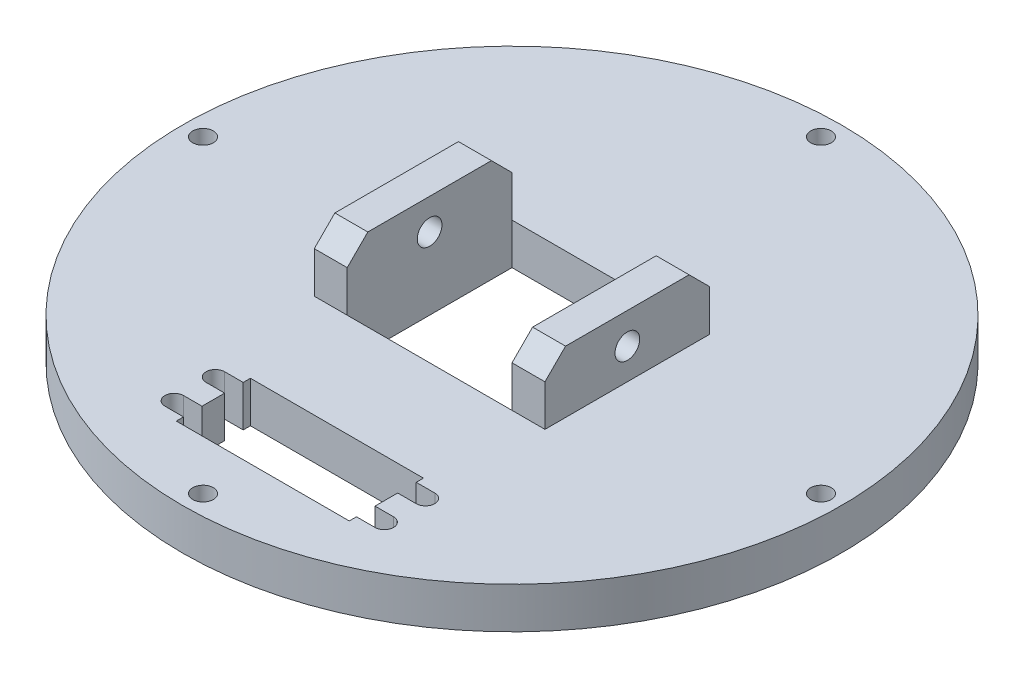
ISO-10303-21;
HEADER;
FILE_DESCRIPTION(('STEP AP214'),'2;1');
FILE_NAME('part.step','',(''),(''),'','','');
FILE_SCHEMA(('AUTOMOTIVE_DESIGN { 1 0 10303 214 1 1 1 1 }'));
ENDSEC;
DATA;
#1=APPLICATION_CONTEXT('core data for automotive mechanical design processes');
#2=APPLICATION_PROTOCOL_DEFINITION('international standard','automotive_design',2000,#1);
#3=PRODUCT_CONTEXT('',#1,'mechanical');
#4=PRODUCT('Part','Part','',(#3));
#5=PRODUCT_RELATED_PRODUCT_CATEGORY('part','',(#4));
#6=PRODUCT_DEFINITION_FORMATION('','',#4);
#7=PRODUCT_DEFINITION_CONTEXT('part definition',#1,'design');
#8=PRODUCT_DEFINITION('design','',#6,#7);
#9=PRODUCT_DEFINITION_SHAPE('','',#8);
#10=(LENGTH_UNIT() NAMED_UNIT(*) SI_UNIT(.MILLI.,.METRE.));
#11=(NAMED_UNIT(*) PLANE_ANGLE_UNIT() SI_UNIT($,.RADIAN.));
#12=(NAMED_UNIT(*) SI_UNIT($,.STERADIAN.) SOLID_ANGLE_UNIT());
#13=UNCERTAINTY_MEASURE_WITH_UNIT(LENGTH_MEASURE(1.E-05),#10,'distance_accuracy_value','');
#14=(GEOMETRIC_REPRESENTATION_CONTEXT(3) GLOBAL_UNCERTAINTY_ASSIGNED_CONTEXT((#13)) GLOBAL_UNIT_ASSIGNED_CONTEXT((#10,
#11,#12)) REPRESENTATION_CONTEXT('',''));
#15=CARTESIAN_POINT('',(0.,0.,0.));
#16=DIRECTION('',(0.,0.,1.));
#17=DIRECTION('',(1.,0.,0.));
#18=AXIS2_PLACEMENT_3D('',#15,#16,#17);
#19=CARTESIAN_POINT('',(0.,10.,0.));
#20=DIRECTION('',(0.,1.,0.));
#21=DIRECTION('',(0.,0.,1.));
#22=AXIS2_PLACEMENT_3D('',#19,#20,#21);
#23=PLANE('',#22);
#24=DIRECTION('',(-1.,0.,0.));
#25=VECTOR('',#24,1.);
#26=CARTESIAN_POINT('',(20.,10.,20.));
#27=LINE('',#26,#25);
#28=CARTESIAN_POINT('',(28.,10.,20.));
#29=VERTEX_POINT('',#28);
#30=CARTESIAN_POINT('',(20.,10.,20.));
#31=VERTEX_POINT('',#30);
#32=EDGE_CURVE('E534',#29,#31,#27,.T.);
#33=ORIENTED_EDGE('',*,*,#32,.T.);
#34=DIRECTION('',(1.,0.,0.));
#35=VECTOR('',#34,1.);
#36=CARTESIAN_POINT('',(-20.,10.,20.));
#37=LINE('',#36,#35);
#38=CARTESIAN_POINT('',(-20.,10.,20.));
#39=VERTEX_POINT('',#38);
#40=EDGE_CURVE('E546',#39,#31,#37,.T.);
#41=ORIENTED_EDGE('',*,*,#40,.F.);
#42=DIRECTION('',(1.,0.,0.));
#43=VECTOR('',#42,1.);
#44=CARTESIAN_POINT('',(-20.,10.,20.));
#45=LINE('',#44,#43);
#46=CARTESIAN_POINT('',(-28.,10.,20.));
#47=VERTEX_POINT('',#46);
#48=EDGE_CURVE('E680',#47,#39,#45,.T.);
#49=ORIENTED_EDGE('',*,*,#48,.F.);
#50=DIRECTION('',(0.,0.,1.));
#51=VECTOR('',#50,1.);
#52=CARTESIAN_POINT('',(-28.,10.,-20.));
#53=LINE('',#52,#51);
#54=CARTESIAN_POINT('',(-28.,10.,-20.));
#55=VERTEX_POINT('',#54);
#56=EDGE_CURVE('E686',#55,#47,#53,.T.);
#57=ORIENTED_EDGE('',*,*,#56,.F.);
#58=DIRECTION('',(-1.,0.,0.));
#59=VECTOR('',#58,1.);
#60=CARTESIAN_POINT('',(-20.,10.,-20.));
#61=LINE('',#60,#59);
#62=CARTESIAN_POINT('',(-20.,10.,-20.));
#63=VERTEX_POINT('',#62);
#64=EDGE_CURVE('E675',#63,#55,#61,.T.);
#65=ORIENTED_EDGE('',*,*,#64,.F.);
#66=DIRECTION('',(-1.,0.,0.));
#67=VECTOR('',#66,1.);
#68=CARTESIAN_POINT('',(-20.,10.,-20.));
#69=LINE('',#68,#67);
#70=CARTESIAN_POINT('',(20.,10.,-20.));
#71=VERTEX_POINT('',#70);
#72=EDGE_CURVE('E566',#71,#63,#69,.T.);
#73=ORIENTED_EDGE('',*,*,#72,.F.);
#74=DIRECTION('',(1.,0.,0.));
#75=VECTOR('',#74,1.);
#76=CARTESIAN_POINT('',(20.,10.,-20.));
#77=LINE('',#76,#75);
#78=CARTESIAN_POINT('',(28.,10.,-20.));
#79=VERTEX_POINT('',#78);
#80=EDGE_CURVE('E652',#71,#79,#77,.T.);
#81=ORIENTED_EDGE('',*,*,#80,.T.);
#82=DIRECTION('',(0.,0.,1.));
#83=VECTOR('',#82,1.);
#84=CARTESIAN_POINT('',(28.,10.,-20.));
#85=LINE('',#84,#83);
#86=EDGE_CURVE('E550',#79,#29,#85,.T.);
#87=ORIENTED_EDGE('',*,*,#86,.T.);
#88=EDGE_LOOP('',(#33,#41,#49,#57,#65,#73,#81,#87));
#89=FACE_BOUND('',#88,.T.);
#90=CARTESIAN_POINT('',(-75.,10.,0.));
#91=DIRECTION('',(0.,1.,0.));
#92=DIRECTION('',(0.,0.,1.));
#93=AXIS2_PLACEMENT_3D('',#90,#91,#92);
#94=CIRCLE('',#93,2.5);
#95=CARTESIAN_POINT('',(-75.,10.,2.5));
#96=VERTEX_POINT('',#95);
#97=EDGE_CURVE('E585',#96,#96,#94,.T.);
#98=ORIENTED_EDGE('',*,*,#97,.F.);
#99=EDGE_LOOP('',(#98));
#100=FACE_BOUND('',#99,.T.);
#101=CARTESIAN_POINT('',(0.,10.,-75.));
#102=DIRECTION('',(0.,1.,0.));
#103=DIRECTION('',(0.,0.,1.));
#104=AXIS2_PLACEMENT_3D('',#101,#102,#103);
#105=CIRCLE('',#104,2.5);
#106=CARTESIAN_POINT('',(0.,10.,-72.5));
#107=VERTEX_POINT('',#106);
#108=EDGE_CURVE('E593',#107,#107,#105,.T.);
#109=ORIENTED_EDGE('',*,*,#108,.F.);
#110=EDGE_LOOP('',(#109));
#111=FACE_BOUND('',#110,.T.);
#112=CARTESIAN_POINT('',(75.,10.,0.));
#113=DIRECTION('',(0.,1.,0.));
#114=DIRECTION('',(0.,0.,1.));
#115=AXIS2_PLACEMENT_3D('',#112,#113,#114);
#116=CIRCLE('',#115,2.5);
#117=CARTESIAN_POINT('',(75.,10.,2.5));
#118=VERTEX_POINT('',#117);
#119=EDGE_CURVE('E599',#118,#118,#116,.T.);
#120=ORIENTED_EDGE('',*,*,#119,.F.);
#121=EDGE_LOOP('',(#120));
#122=FACE_BOUND('',#121,.T.);
#123=CARTESIAN_POINT('',(0.,10.,75.));
#124=DIRECTION('',(0.,1.,0.));
#125=DIRECTION('',(0.,0.,1.));
#126=AXIS2_PLACEMENT_3D('',#123,#124,#125);
#127=CIRCLE('',#126,2.5);
#128=CARTESIAN_POINT('',(0.,10.,77.5));
#129=VERTEX_POINT('',#128);
#130=EDGE_CURVE('E584',#129,#129,#127,.T.);
#131=ORIENTED_EDGE('',*,*,#130,.F.);
#132=EDGE_LOOP('',(#131));
#133=FACE_BOUND('',#132,.T.);
#134=CARTESIAN_POINT('',(0.,10.,0.));
#135=DIRECTION('',(0.,1.,0.));
#136=DIRECTION('',(0.,0.,1.));
#137=AXIS2_PLACEMENT_3D('',#134,#135,#136);
#138=CIRCLE('',#137,80.);
#139=CARTESIAN_POINT('',(0.,10.,80.));
#140=VERTEX_POINT('',#139);
#141=EDGE_CURVE('E609',#140,#140,#138,.T.);
#142=ORIENTED_EDGE('',*,*,#141,.T.);
#143=EDGE_LOOP('',(#142));
#144=FACE_BOUND('',#143,.T.);
#145=DIRECTION('',(0.,0.,1.));
#146=VECTOR('',#145,1.);
#147=CARTESIAN_POINT('',(23.5,10.,0.));
#148=LINE('',#147,#146);
#149=CARTESIAN_POINT('',(23.5,10.,45.));
#150=VERTEX_POINT('',#149);
#151=CARTESIAN_POINT('',(23.5,10.,46.75));
#152=VERTEX_POINT('',#151);
#153=EDGE_CURVE('E791',#150,#152,#148,.T.);
#154=ORIENTED_EDGE('',*,*,#153,.T.);
#155=DIRECTION('',(1.,0.,0.));
#156=VECTOR('',#155,1.);
#157=CARTESIAN_POINT('',(0.,10.,46.75));
#158=LINE('',#157,#156);
#159=CARTESIAN_POINT('',(28.,10.,46.75));
#160=VERTEX_POINT('',#159);
#161=EDGE_CURVE('E798',#152,#160,#158,.T.);
#162=ORIENTED_EDGE('',*,*,#161,.T.);
#163=CARTESIAN_POINT('',(28.,10.,49.));
#164=DIRECTION('',(0.,1.,0.));
#165=DIRECTION('',(0.,0.,1.));
#166=AXIS2_PLACEMENT_3D('',#163,#164,#165);
#167=CIRCLE('',#166,2.25);
#168=CARTESIAN_POINT('',(28.,10.,51.25));
#169=VERTEX_POINT('',#168);
#170=EDGE_CURVE('E795',#169,#160,#167,.T.);
#171=ORIENTED_EDGE('',*,*,#170,.F.);
#172=DIRECTION('',(1.,0.,0.));
#173=VECTOR('',#172,1.);
#174=CARTESIAN_POINT('',(0.,10.,51.25));
#175=LINE('',#174,#173);
#176=CARTESIAN_POINT('',(23.5,10.,51.25));
#177=VERTEX_POINT('',#176);
#178=EDGE_CURVE('E792',#177,#169,#175,.T.);
#179=ORIENTED_EDGE('',*,*,#178,.F.);
#180=CARTESIAN_POINT('',(23.5,10.,56.75));
#181=VERTEX_POINT('',#180);
#182=EDGE_CURVE('E790',#177,#181,#148,.T.);
#183=ORIENTED_EDGE('',*,*,#182,.T.);
#184=DIRECTION('',(1.,0.,0.));
#185=VECTOR('',#184,1.);
#186=CARTESIAN_POINT('',(0.,10.,56.75));
#187=LINE('',#186,#185);
#188=CARTESIAN_POINT('',(28.,10.,56.75));
#189=VERTEX_POINT('',#188);
#190=EDGE_CURVE('E710',#181,#189,#187,.T.);
#191=ORIENTED_EDGE('',*,*,#190,.T.);
#192=CARTESIAN_POINT('',(28.,10.,59.));
#193=DIRECTION('',(0.,1.,0.));
#194=DIRECTION('',(0.,0.,1.));
#195=AXIS2_PLACEMENT_3D('',#192,#193,#194);
#196=CIRCLE('',#195,2.25);
#197=CARTESIAN_POINT('',(28.,10.,61.25));
#198=VERTEX_POINT('',#197);
#199=EDGE_CURVE('E707',#198,#189,#196,.T.);
#200=ORIENTED_EDGE('',*,*,#199,.F.);
#201=DIRECTION('',(1.,0.,0.));
#202=VECTOR('',#201,1.);
#203=CARTESIAN_POINT('',(0.,10.,61.25));
#204=LINE('',#203,#202);
#205=CARTESIAN_POINT('',(23.5,10.,61.25));
#206=VERTEX_POINT('',#205);
#207=EDGE_CURVE('E704',#206,#198,#204,.T.);
#208=ORIENTED_EDGE('',*,*,#207,.F.);
#209=CARTESIAN_POINT('',(23.5,10.,63.));
#210=VERTEX_POINT('',#209);
#211=EDGE_CURVE('E787',#206,#210,#148,.T.);
#212=ORIENTED_EDGE('',*,*,#211,.T.);
#213=DIRECTION('',(1.,0.,0.));
#214=VECTOR('',#213,1.);
#215=CARTESIAN_POINT('',(0.,10.,63.));
#216=LINE('',#215,#214);
#217=CARTESIAN_POINT('',(-18.5,10.,63.));
#218=VERTEX_POINT('',#217);
#219=EDGE_CURVE('E783',#218,#210,#216,.T.);
#220=ORIENTED_EDGE('',*,*,#219,.F.);
#221=DIRECTION('',(0.,0.,1.));
#222=VECTOR('',#221,1.);
#223=CARTESIAN_POINT('',(-18.5,10.,0.));
#224=LINE('',#223,#222);
#225=CARTESIAN_POINT('',(-18.5,10.,61.25));
#226=VERTEX_POINT('',#225);
#227=EDGE_CURVE('E780',#226,#218,#224,.T.);
#228=ORIENTED_EDGE('',*,*,#227,.F.);
#229=DIRECTION('',(1.,0.,0.));
#230=VECTOR('',#229,1.);
#231=CARTESIAN_POINT('',(0.,10.,61.25));
#232=LINE('',#231,#230);
#233=CARTESIAN_POINT('',(-23.,10.,61.25));
#234=VERTEX_POINT('',#233);
#235=EDGE_CURVE('E777',#234,#226,#232,.T.);
#236=ORIENTED_EDGE('',*,*,#235,.F.);
#237=CARTESIAN_POINT('',(-23.,10.,59.));
#238=DIRECTION('',(0.,1.,0.));
#239=DIRECTION('',(0.,0.,1.));
#240=AXIS2_PLACEMENT_3D('',#237,#238,#239);
#241=CIRCLE('',#240,2.25);
#242=CARTESIAN_POINT('',(-23.,10.,56.75));
#243=VERTEX_POINT('',#242);
#244=EDGE_CURVE('E774',#243,#234,#241,.T.);
#245=ORIENTED_EDGE('',*,*,#244,.F.);
#246=DIRECTION('',(1.,0.,0.));
#247=VECTOR('',#246,1.);
#248=CARTESIAN_POINT('',(0.,10.,56.75));
#249=LINE('',#248,#247);
#250=CARTESIAN_POINT('',(-18.5,10.,56.75));
#251=VERTEX_POINT('',#250);
#252=EDGE_CURVE('E771',#243,#251,#249,.T.);
#253=ORIENTED_EDGE('',*,*,#252,.T.);
#254=CARTESIAN_POINT('',(-18.5,10.,51.25));
#255=VERTEX_POINT('',#254);
#256=EDGE_CURVE('E784',#255,#251,#224,.T.);
#257=ORIENTED_EDGE('',*,*,#256,.F.);
#258=DIRECTION('',(1.,0.,0.));
#259=VECTOR('',#258,1.);
#260=CARTESIAN_POINT('',(0.,10.,51.25));
#261=LINE('',#260,#259);
#262=CARTESIAN_POINT('',(-23.,10.,51.25));
#263=VERTEX_POINT('',#262);
#264=EDGE_CURVE('E810',#263,#255,#261,.T.);
#265=ORIENTED_EDGE('',*,*,#264,.F.);
#266=CARTESIAN_POINT('',(-23.,10.,49.));
#267=DIRECTION('',(0.,1.,0.));
#268=DIRECTION('',(0.,0.,1.));
#269=AXIS2_PLACEMENT_3D('',#266,#267,#268);
#270=CIRCLE('',#269,2.25);
#271=CARTESIAN_POINT('',(-23.,10.,46.75));
#272=VERTEX_POINT('',#271);
#273=EDGE_CURVE('E807',#272,#263,#270,.T.);
#274=ORIENTED_EDGE('',*,*,#273,.F.);
#275=DIRECTION('',(1.,0.,0.));
#276=VECTOR('',#275,1.);
#277=CARTESIAN_POINT('',(0.,10.,46.75));
#278=LINE('',#277,#276);
#279=CARTESIAN_POINT('',(-18.5,10.,46.75));
#280=VERTEX_POINT('',#279);
#281=EDGE_CURVE('E804',#272,#280,#278,.T.);
#282=ORIENTED_EDGE('',*,*,#281,.T.);
#283=CARTESIAN_POINT('',(-18.5,10.,45.));
#284=VERTEX_POINT('',#283);
#285=EDGE_CURVE('E785',#284,#280,#224,.T.);
#286=ORIENTED_EDGE('',*,*,#285,.F.);
#287=DIRECTION('',(1.,0.,0.));
#288=VECTOR('',#287,1.);
#289=CARTESIAN_POINT('',(0.,10.,45.));
#290=LINE('',#289,#288);
#291=EDGE_CURVE('E801',#284,#150,#290,.T.);
#292=ORIENTED_EDGE('',*,*,#291,.T.);
#293=EDGE_LOOP('',(#154,#162,#171,#179,#183,#191,#200,#208,#212,#220,#228,#236,#245,#253,#257,
#265,#274,#282,#286,#292));
#294=FACE_BOUND('',#293,.T.);
#295=ADVANCED_FACE('F307',(#89,#100,#111,#122,#133,#144,#294),#23,.T.);
#296=CARTESIAN_POINT('',(0.,0.,0.));
#297=DIRECTION('',(0.,1.,0.));
#298=DIRECTION('',(0.,0.,1.));
#299=AXIS2_PLACEMENT_3D('',#296,#297,#298);
#300=PLANE('',#299);
#301=CARTESIAN_POINT('',(0.,0.,0.));
#302=DIRECTION('',(0.,1.,0.));
#303=DIRECTION('',(0.,0.,1.));
#304=AXIS2_PLACEMENT_3D('',#301,#302,#303);
#305=CIRCLE('',#304,80.);
#306=CARTESIAN_POINT('',(0.,0.,80.));
#307=VERTEX_POINT('',#306);
#308=EDGE_CURVE('E592',#307,#307,#305,.T.);
#309=ORIENTED_EDGE('',*,*,#308,.F.);
#310=EDGE_LOOP('',(#309));
#311=FACE_BOUND('',#310,.T.);
#312=CARTESIAN_POINT('',(0.,0.,75.));
#313=DIRECTION('',(0.,1.,0.));
#314=DIRECTION('',(0.,0.,1.));
#315=AXIS2_PLACEMENT_3D('',#312,#313,#314);
#316=CIRCLE('',#315,2.5);
#317=CARTESIAN_POINT('',(0.,0.,77.5));
#318=VERTEX_POINT('',#317);
#319=EDGE_CURVE('E602',#318,#318,#316,.F.);
#320=ORIENTED_EDGE('',*,*,#319,.F.);
#321=EDGE_LOOP('',(#320));
#322=FACE_BOUND('',#321,.T.);
#323=CARTESIAN_POINT('',(75.,0.,0.));
#324=DIRECTION('',(0.,1.,0.));
#325=DIRECTION('',(0.,0.,1.));
#326=AXIS2_PLACEMENT_3D('',#323,#324,#325);
#327=CIRCLE('',#326,2.5);
#328=CARTESIAN_POINT('',(75.,0.,2.5));
#329=VERTEX_POINT('',#328);
#330=EDGE_CURVE('E596',#329,#329,#327,.F.);
#331=ORIENTED_EDGE('',*,*,#330,.F.);
#332=EDGE_LOOP('',(#331));
#333=FACE_BOUND('',#332,.T.);
#334=CARTESIAN_POINT('',(0.,0.,-75.));
#335=DIRECTION('',(0.,1.,0.));
#336=DIRECTION('',(0.,0.,1.));
#337=AXIS2_PLACEMENT_3D('',#334,#335,#336);
#338=CIRCLE('',#337,2.5);
#339=CARTESIAN_POINT('',(0.,0.,-72.5));
#340=VERTEX_POINT('',#339);
#341=EDGE_CURVE('E589',#340,#340,#338,.F.);
#342=ORIENTED_EDGE('',*,*,#341,.F.);
#343=EDGE_LOOP('',(#342));
#344=FACE_BOUND('',#343,.T.);
#345=CARTESIAN_POINT('',(-75.,0.,0.));
#346=DIRECTION('',(0.,1.,0.));
#347=DIRECTION('',(0.,0.,1.));
#348=AXIS2_PLACEMENT_3D('',#345,#346,#347);
#349=CIRCLE('',#348,2.5);
#350=CARTESIAN_POINT('',(-75.,0.,2.5));
#351=VERTEX_POINT('',#350);
#352=EDGE_CURVE('E588',#351,#351,#349,.F.);
#353=ORIENTED_EDGE('',*,*,#352,.F.);
#354=EDGE_LOOP('',(#353));
#355=FACE_BOUND('',#354,.T.);
#356=DIRECTION('',(1.,0.,0.));
#357=VECTOR('',#356,1.);
#358=CARTESIAN_POINT('',(-20.,0.,-20.));
#359=LINE('',#358,#357);
#360=CARTESIAN_POINT('',(-20.,0.,-20.));
#361=VERTEX_POINT('',#360);
#362=CARTESIAN_POINT('',(20.,0.,-20.));
#363=VERTEX_POINT('',#362);
#364=EDGE_CURVE('E572',#361,#363,#359,.T.);
#365=ORIENTED_EDGE('',*,*,#364,.F.);
#366=DIRECTION('',(0.,0.,-1.));
#367=VECTOR('',#366,1.);
#368=CARTESIAN_POINT('',(-20.,0.,-20.));
#369=LINE('',#368,#367);
#370=CARTESIAN_POINT('',(-20.,0.,20.));
#371=VERTEX_POINT('',#370);
#372=EDGE_CURVE('E567',#371,#361,#369,.T.);
#373=ORIENTED_EDGE('',*,*,#372,.F.);
#374=DIRECTION('',(-1.,0.,0.));
#375=VECTOR('',#374,1.);
#376=CARTESIAN_POINT('',(-20.,0.,20.));
#377=LINE('',#376,#375);
#378=CARTESIAN_POINT('',(20.,0.,20.));
#379=VERTEX_POINT('',#378);
#380=EDGE_CURVE('E579',#379,#371,#377,.T.);
#381=ORIENTED_EDGE('',*,*,#380,.F.);
#382=DIRECTION('',(0.,0.,1.));
#383=VECTOR('',#382,1.);
#384=CARTESIAN_POINT('',(20.,0.,-20.));
#385=LINE('',#384,#383);
#386=EDGE_CURVE('E557',#363,#379,#385,.T.);
#387=ORIENTED_EDGE('',*,*,#386,.F.);
#388=EDGE_LOOP('',(#365,#373,#381,#387));
#389=FACE_BOUND('',#388,.T.);
#390=DIRECTION('',(-1.,0.,0.));
#391=VECTOR('',#390,1.);
#392=CARTESIAN_POINT('',(0.,0.,46.75));
#393=LINE('',#392,#391);
#394=CARTESIAN_POINT('',(28.,0.,46.75));
#395=VERTEX_POINT('',#394);
#396=CARTESIAN_POINT('',(23.5,0.,46.75));
#397=VERTEX_POINT('',#396);
#398=EDGE_CURVE('E744',#395,#397,#393,.T.);
#399=ORIENTED_EDGE('',*,*,#398,.T.);
#400=DIRECTION('',(0.,0.,-1.));
#401=VECTOR('',#400,1.);
#402=CARTESIAN_POINT('',(23.5,0.,0.));
#403=LINE('',#402,#401);
#404=CARTESIAN_POINT('',(23.5,0.,45.));
#405=VERTEX_POINT('',#404);
#406=EDGE_CURVE('E747',#397,#405,#403,.T.);
#407=ORIENTED_EDGE('',*,*,#406,.T.);
#408=DIRECTION('',(-1.,0.,0.));
#409=VECTOR('',#408,1.);
#410=CARTESIAN_POINT('',(0.,0.,45.));
#411=LINE('',#410,#409);
#412=CARTESIAN_POINT('',(-18.5,0.,45.));
#413=VERTEX_POINT('',#412);
#414=EDGE_CURVE('E750',#405,#413,#411,.T.);
#415=ORIENTED_EDGE('',*,*,#414,.T.);
#416=DIRECTION('',(0.,0.,-1.));
#417=VECTOR('',#416,1.);
#418=CARTESIAN_POINT('',(-18.5,0.,0.));
#419=LINE('',#418,#417);
#420=CARTESIAN_POINT('',(-18.5,0.,46.75));
#421=VERTEX_POINT('',#420);
#422=EDGE_CURVE('E753',#421,#413,#419,.T.);
#423=ORIENTED_EDGE('',*,*,#422,.F.);
#424=DIRECTION('',(-1.,0.,0.));
#425=VECTOR('',#424,1.);
#426=CARTESIAN_POINT('',(0.,0.,46.75));
#427=LINE('',#426,#425);
#428=CARTESIAN_POINT('',(-23.,0.,46.75));
#429=VERTEX_POINT('',#428);
#430=EDGE_CURVE('E756',#421,#429,#427,.T.);
#431=ORIENTED_EDGE('',*,*,#430,.T.);
#432=CARTESIAN_POINT('',(-23.,0.,49.));
#433=DIRECTION('',(0.,1.,0.));
#434=DIRECTION('',(0.,0.,1.));
#435=AXIS2_PLACEMENT_3D('',#432,#433,#434);
#436=CIRCLE('',#435,2.25);
#437=CARTESIAN_POINT('',(-23.,0.,51.25));
#438=VERTEX_POINT('',#437);
#439=EDGE_CURVE('E759',#438,#429,#436,.F.);
#440=ORIENTED_EDGE('',*,*,#439,.F.);
#441=DIRECTION('',(-1.,0.,0.));
#442=VECTOR('',#441,1.);
#443=CARTESIAN_POINT('',(0.,0.,51.25));
#444=LINE('',#443,#442);
#445=CARTESIAN_POINT('',(-18.5,0.,51.25));
#446=VERTEX_POINT('',#445);
#447=EDGE_CURVE('E762',#446,#438,#444,.T.);
#448=ORIENTED_EDGE('',*,*,#447,.F.);
#449=DIRECTION('',(0.,0.,-1.));
#450=VECTOR('',#449,1.);
#451=CARTESIAN_POINT('',(-18.5,0.,0.));
#452=LINE('',#451,#450);
#453=CARTESIAN_POINT('',(-18.5,0.,56.75));
#454=VERTEX_POINT('',#453);
#455=EDGE_CURVE('E765',#454,#446,#452,.T.);
#456=ORIENTED_EDGE('',*,*,#455,.F.);
#457=DIRECTION('',(-1.,0.,0.));
#458=VECTOR('',#457,1.);
#459=CARTESIAN_POINT('',(0.,0.,56.75));
#460=LINE('',#459,#458);
#461=CARTESIAN_POINT('',(-23.,0.,56.75));
#462=VERTEX_POINT('',#461);
#463=EDGE_CURVE('E768',#454,#462,#460,.T.);
#464=ORIENTED_EDGE('',*,*,#463,.T.);
#465=CARTESIAN_POINT('',(-23.,0.,59.));
#466=DIRECTION('',(0.,1.,0.));
#467=DIRECTION('',(0.,0.,1.));
#468=AXIS2_PLACEMENT_3D('',#465,#466,#467);
#469=CIRCLE('',#468,2.25);
#470=CARTESIAN_POINT('',(-23.,0.,61.25));
#471=VERTEX_POINT('',#470);
#472=EDGE_CURVE('E702',#471,#462,#469,.F.);
#473=ORIENTED_EDGE('',*,*,#472,.F.);
#474=DIRECTION('',(-1.,0.,0.));
#475=VECTOR('',#474,1.);
#476=CARTESIAN_POINT('',(0.,0.,61.25));
#477=LINE('',#476,#475);
#478=CARTESIAN_POINT('',(-18.5,0.,61.25));
#479=VERTEX_POINT('',#478);
#480=EDGE_CURVE('E697',#479,#471,#477,.T.);
#481=ORIENTED_EDGE('',*,*,#480,.F.);
#482=DIRECTION('',(0.,0.,-1.));
#483=VECTOR('',#482,1.);
#484=CARTESIAN_POINT('',(-18.5,0.,0.));
#485=LINE('',#484,#483);
#486=CARTESIAN_POINT('',(-18.5,0.,63.));
#487=VERTEX_POINT('',#486);
#488=EDGE_CURVE('E726',#487,#479,#485,.T.);
#489=ORIENTED_EDGE('',*,*,#488,.F.);
#490=DIRECTION('',(-1.,0.,0.));
#491=VECTOR('',#490,1.);
#492=CARTESIAN_POINT('',(0.,0.,63.));
#493=LINE('',#492,#491);
#494=CARTESIAN_POINT('',(23.5,0.,63.));
#495=VERTEX_POINT('',#494);
#496=EDGE_CURVE('E729',#495,#487,#493,.T.);
#497=ORIENTED_EDGE('',*,*,#496,.F.);
#498=DIRECTION('',(0.,0.,-1.));
#499=VECTOR('',#498,1.);
#500=CARTESIAN_POINT('',(23.5,0.,0.));
#501=LINE('',#500,#499);
#502=CARTESIAN_POINT('',(23.5,0.,61.25));
#503=VERTEX_POINT('',#502);
#504=EDGE_CURVE('E732',#495,#503,#501,.T.);
#505=ORIENTED_EDGE('',*,*,#504,.T.);
#506=DIRECTION('',(-1.,0.,0.));
#507=VECTOR('',#506,1.);
#508=CARTESIAN_POINT('',(0.,0.,61.25));
#509=LINE('',#508,#507);
#510=CARTESIAN_POINT('',(28.,0.,61.25));
#511=VERTEX_POINT('',#510);
#512=EDGE_CURVE('E701',#511,#503,#509,.T.);
#513=ORIENTED_EDGE('',*,*,#512,.F.);
#514=CARTESIAN_POINT('',(28.,0.,59.));
#515=DIRECTION('',(0.,1.,0.));
#516=DIRECTION('',(0.,0.,1.));
#517=AXIS2_PLACEMENT_3D('',#514,#515,#516);
#518=CIRCLE('',#517,2.25);
#519=CARTESIAN_POINT('',(28.,0.,56.75));
#520=VERTEX_POINT('',#519);
#521=EDGE_CURVE('E716',#520,#511,#518,.F.);
#522=ORIENTED_EDGE('',*,*,#521,.F.);
#523=DIRECTION('',(-1.,0.,0.));
#524=VECTOR('',#523,1.);
#525=CARTESIAN_POINT('',(0.,0.,56.75));
#526=LINE('',#525,#524);
#527=CARTESIAN_POINT('',(23.5,0.,56.75));
#528=VERTEX_POINT('',#527);
#529=EDGE_CURVE('E698',#520,#528,#526,.T.);
#530=ORIENTED_EDGE('',*,*,#529,.T.);
#531=DIRECTION('',(0.,0.,-1.));
#532=VECTOR('',#531,1.);
#533=CARTESIAN_POINT('',(23.5,0.,0.));
#534=LINE('',#533,#532);
#535=CARTESIAN_POINT('',(23.5,0.,51.25));
#536=VERTEX_POINT('',#535);
#537=EDGE_CURVE('E735',#528,#536,#534,.T.);
#538=ORIENTED_EDGE('',*,*,#537,.T.);
#539=DIRECTION('',(-1.,0.,0.));
#540=VECTOR('',#539,1.);
#541=CARTESIAN_POINT('',(0.,0.,51.25));
#542=LINE('',#541,#540);
#543=CARTESIAN_POINT('',(28.,0.,51.25));
#544=VERTEX_POINT('',#543);
#545=EDGE_CURVE('E738',#544,#536,#542,.T.);
#546=ORIENTED_EDGE('',*,*,#545,.F.);
#547=CARTESIAN_POINT('',(28.,0.,49.));
#548=DIRECTION('',(0.,1.,0.));
#549=DIRECTION('',(0.,0.,1.));
#550=AXIS2_PLACEMENT_3D('',#547,#548,#549);
#551=CIRCLE('',#550,2.25);
#552=EDGE_CURVE('E741',#395,#544,#551,.F.);
#553=ORIENTED_EDGE('',*,*,#552,.F.);
#554=EDGE_LOOP('',(#399,#407,#415,#423,#431,#440,#448,#456,#464,#473,#481,#489,#497,#505,#513,
#522,#530,#538,#546,#553));
#555=FACE_BOUND('',#554,.T.);
#556=ADVANCED_FACE('F855',(#311,#322,#333,#344,#355,#389,#555),#300,.F.);
#557=CARTESIAN_POINT('',(0.,10.,0.));
#558=DIRECTION('',(0.,-1.,0.));
#559=DIRECTION('',(0.,0.,-1.));
#560=AXIS2_PLACEMENT_3D('',#557,#558,#559);
#561=CYLINDRICAL_SURFACE('',#560,80.);
#562=ORIENTED_EDGE('',*,*,#141,.F.);
#563=EDGE_LOOP('',(#562));
#564=FACE_BOUND('',#563,.T.);
#565=ORIENTED_EDGE('',*,*,#308,.T.);
#566=EDGE_LOOP('',(#565));
#567=FACE_BOUND('',#566,.T.);
#568=ADVANCED_FACE('F911',(#564,#567),#561,.T.);
#569=CARTESIAN_POINT('',(0.,-0.000999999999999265,75.));
#570=DIRECTION('',(0.,1.,0.));
#571=DIRECTION('',(0.,0.,1.));
#572=AXIS2_PLACEMENT_3D('',#569,#570,#571);
#573=CYLINDRICAL_SURFACE('',#572,2.5);
#574=ORIENTED_EDGE('',*,*,#130,.T.);
#575=EDGE_LOOP('',(#574));
#576=FACE_BOUND('',#575,.T.);
#577=ORIENTED_EDGE('',*,*,#319,.T.);
#578=EDGE_LOOP('',(#577));
#579=FACE_BOUND('',#578,.T.);
#580=ADVANCED_FACE('F915',(#576,#579),#573,.F.);
#581=CARTESIAN_POINT('',(75.,-0.000999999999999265,0.));
#582=DIRECTION('',(0.,1.,0.));
#583=DIRECTION('',(0.,0.,1.));
#584=AXIS2_PLACEMENT_3D('',#581,#582,#583);
#585=CYLINDRICAL_SURFACE('',#584,2.5);
#586=ORIENTED_EDGE('',*,*,#119,.T.);
#587=EDGE_LOOP('',(#586));
#588=FACE_BOUND('',#587,.T.);
#589=ORIENTED_EDGE('',*,*,#330,.T.);
#590=EDGE_LOOP('',(#589));
#591=FACE_BOUND('',#590,.T.);
#592=ADVANCED_FACE('F1037',(#588,#591),#585,.F.);
#593=CARTESIAN_POINT('',(0.,-0.000999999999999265,-75.));
#594=DIRECTION('',(0.,1.,0.));
#595=DIRECTION('',(0.,0.,1.));
#596=AXIS2_PLACEMENT_3D('',#593,#594,#595);
#597=CYLINDRICAL_SURFACE('',#596,2.5);
#598=ORIENTED_EDGE('',*,*,#108,.T.);
#599=EDGE_LOOP('',(#598));
#600=FACE_BOUND('',#599,.T.);
#601=ORIENTED_EDGE('',*,*,#341,.T.);
#602=EDGE_LOOP('',(#601));
#603=FACE_BOUND('',#602,.T.);
#604=ADVANCED_FACE('F1034',(#600,#603),#597,.F.);
#605=CARTESIAN_POINT('',(-75.,-0.000999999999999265,0.));
#606=DIRECTION('',(0.,1.,0.));
#607=DIRECTION('',(0.,0.,1.));
#608=AXIS2_PLACEMENT_3D('',#605,#606,#607);
#609=CYLINDRICAL_SURFACE('',#608,2.5);
#610=ORIENTED_EDGE('',*,*,#97,.T.);
#611=EDGE_LOOP('',(#610));
#612=FACE_BOUND('',#611,.T.);
#613=ORIENTED_EDGE('',*,*,#352,.T.);
#614=EDGE_LOOP('',(#613));
#615=FACE_BOUND('',#614,.T.);
#616=ADVANCED_FACE('F1030',(#612,#615),#609,.F.);
#617=CARTESIAN_POINT('',(-20.,-0.000999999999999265,-20.));
#618=DIRECTION('',(-1.,0.,0.));
#619=DIRECTION('',(0.,0.,1.));
#620=AXIS2_PLACEMENT_3D('',#617,#618,#619);
#621=PLANE('',#620);
#622=CARTESIAN_POINT('',(-20.,17.5,0.));
#623=DIRECTION('',(-1.,0.,0.));
#624=DIRECTION('',(0.,0.,1.));
#625=AXIS2_PLACEMENT_3D('',#622,#623,#624);
#626=CIRCLE('',#625,3.);
#627=CARTESIAN_POINT('',(-20.,17.5,3.00000000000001));
#628=VERTEX_POINT('',#627);
#629=EDGE_CURVE('E672',#628,#628,#626,.F.);
#630=ORIENTED_EDGE('',*,*,#629,.F.);
#631=EDGE_LOOP('',(#630));
#632=FACE_BOUND('',#631,.T.);
#633=DIRECTION('',(0.,-1.,0.));
#634=VECTOR('',#633,1.);
#635=CARTESIAN_POINT('',(-20.,25.,-20.));
#636=LINE('',#635,#634);
#637=CARTESIAN_POINT('',(-20.,20.,-20.));
#638=VERTEX_POINT('',#637);
#639=EDGE_CURVE('E695',#638,#63,#636,.T.);
#640=ORIENTED_EDGE('',*,*,#639,.F.);
#641=DIRECTION('',(0.,-0.707106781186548,-0.707106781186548));
#642=VECTOR('',#641,1.);
#643=CARTESIAN_POINT('',(-20.,25.,-15.));
#644=LINE('',#643,#642);
#645=CARTESIAN_POINT('',(-20.,25.,-15.));
#646=VERTEX_POINT('',#645);
#647=EDGE_CURVE('E628',#638,#646,#644,.F.);
#648=ORIENTED_EDGE('',*,*,#647,.T.);
#649=DIRECTION('',(0.,0.,-1.));
#650=VECTOR('',#649,1.);
#651=CARTESIAN_POINT('',(-20.,25.,-20.));
#652=LINE('',#651,#650);
#653=CARTESIAN_POINT('',(-20.,25.,15.));
#654=VERTEX_POINT('',#653);
#655=EDGE_CURVE('E676',#654,#646,#652,.T.);
#656=ORIENTED_EDGE('',*,*,#655,.F.);
#657=DIRECTION('',(0.,0.707106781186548,-0.707106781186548));
#658=VECTOR('',#657,1.);
#659=CARTESIAN_POINT('',(-20.,25.,15.));
#660=LINE('',#659,#658);
#661=CARTESIAN_POINT('',(-20.,20.,20.));
#662=VERTEX_POINT('',#661);
#663=EDGE_CURVE('E626',#654,#662,#660,.F.);
#664=ORIENTED_EDGE('',*,*,#663,.T.);
#665=DIRECTION('',(0.,-1.,0.));
#666=VECTOR('',#665,1.);
#667=CARTESIAN_POINT('',(-20.,25.,20.));
#668=LINE('',#667,#666);
#669=EDGE_CURVE('E683',#662,#39,#668,.T.);
#670=ORIENTED_EDGE('',*,*,#669,.T.);
#671=DIRECTION('',(0.,1.,0.));
#672=VECTOR('',#671,1.);
#673=CARTESIAN_POINT('',(-20.,-0.000999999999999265,20.));
#674=LINE('',#673,#672);
#675=EDGE_CURVE('E562',#371,#39,#674,.T.);
#676=ORIENTED_EDGE('',*,*,#675,.F.);
#677=ORIENTED_EDGE('',*,*,#372,.T.);
#678=DIRECTION('',(0.,1.,0.));
#679=VECTOR('',#678,1.);
#680=CARTESIAN_POINT('',(-20.,-0.000999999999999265,-20.));
#681=LINE('',#680,#679);
#682=EDGE_CURVE('E576',#361,#63,#681,.T.);
#683=ORIENTED_EDGE('',*,*,#682,.T.);
#684=EDGE_LOOP('',(#640,#648,#656,#664,#670,#676,#677,#683));
#685=FACE_BOUND('',#684,.T.);
#686=ADVANCED_FACE('F859',(#632,#685),#621,.F.);
#687=CARTESIAN_POINT('',(-20.,-0.000999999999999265,-20.));
#688=DIRECTION('',(0.,0.,-1.));
#689=DIRECTION('',(-1.,0.,0.));
#690=AXIS2_PLACEMENT_3D('',#687,#688,#689);
#691=PLANE('',#690);
#692=ORIENTED_EDGE('',*,*,#364,.T.);
#693=DIRECTION('',(0.,1.,0.));
#694=VECTOR('',#693,1.);
#695=CARTESIAN_POINT('',(20.,-0.000999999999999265,-20.));
#696=LINE('',#695,#694);
#697=EDGE_CURVE('E561',#363,#71,#696,.T.);
#698=ORIENTED_EDGE('',*,*,#697,.T.);
#699=ORIENTED_EDGE('',*,*,#72,.T.);
#700=ORIENTED_EDGE('',*,*,#682,.F.);
#701=EDGE_LOOP('',(#692,#698,#699,#700));
#702=FACE_BOUND('',#701,.T.);
#703=ADVANCED_FACE('F851',(#702),#691,.F.);
#704=CARTESIAN_POINT('',(20.,-0.000999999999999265,-20.));
#705=DIRECTION('',(1.,0.,0.));
#706=DIRECTION('',(0.,0.,-1.));
#707=AXIS2_PLACEMENT_3D('',#704,#705,#706);
#708=PLANE('',#707);
#709=CARTESIAN_POINT('',(20.,17.5,0.));
#710=DIRECTION('',(1.,0.,0.));
#711=DIRECTION('',(0.,0.,-1.));
#712=AXIS2_PLACEMENT_3D('',#709,#710,#711);
#713=CIRCLE('',#712,3.);
#714=CARTESIAN_POINT('',(20.,17.5,-3.));
#715=VERTEX_POINT('',#714);
#716=EDGE_CURVE('E1014',#715,#715,#713,.T.);
#717=ORIENTED_EDGE('',*,*,#716,.T.);
#718=EDGE_LOOP('',(#717));
#719=FACE_BOUND('',#718,.T.);
#720=DIRECTION('',(0.,0.,-1.));
#721=VECTOR('',#720,1.);
#722=CARTESIAN_POINT('',(20.,25.,-20.));
#723=LINE('',#722,#721);
#724=CARTESIAN_POINT('',(20.,25.,15.));
#725=VERTEX_POINT('',#724);
#726=CARTESIAN_POINT('',(20.,25.,-15.));
#727=VERTEX_POINT('',#726);
#728=EDGE_CURVE('E646',#725,#727,#723,.T.);
#729=ORIENTED_EDGE('',*,*,#728,.T.);
#730=DIRECTION('',(0.,-0.707106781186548,-0.707106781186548));
#731=VECTOR('',#730,1.);
#732=CARTESIAN_POINT('',(20.,20.,-20.));
#733=LINE('',#732,#731);
#734=CARTESIAN_POINT('',(20.,20.,-20.));
#735=VERTEX_POINT('',#734);
#736=EDGE_CURVE('E315',#727,#735,#733,.T.);
#737=ORIENTED_EDGE('',*,*,#736,.T.);
#738=DIRECTION('',(0.,-1.,0.));
#739=VECTOR('',#738,1.);
#740=CARTESIAN_POINT('',(20.,25.,-20.));
#741=LINE('',#740,#739);
#742=EDGE_CURVE('E644',#735,#71,#741,.T.);
#743=ORIENTED_EDGE('',*,*,#742,.T.);
#744=ORIENTED_EDGE('',*,*,#697,.F.);
#745=ORIENTED_EDGE('',*,*,#386,.T.);
#746=DIRECTION('',(0.,1.,0.));
#747=VECTOR('',#746,1.);
#748=CARTESIAN_POINT('',(20.,-0.000999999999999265,20.));
#749=LINE('',#748,#747);
#750=EDGE_CURVE('E554',#379,#31,#749,.T.);
#751=ORIENTED_EDGE('',*,*,#750,.T.);
#752=DIRECTION('',(0.,-1.,0.));
#753=VECTOR('',#752,1.);
#754=CARTESIAN_POINT('',(20.,25.,20.));
#755=LINE('',#754,#753);
#756=CARTESIAN_POINT('',(20.,20.,20.));
#757=VERTEX_POINT('',#756);
#758=EDGE_CURVE('E530',#757,#31,#755,.T.);
#759=ORIENTED_EDGE('',*,*,#758,.F.);
#760=DIRECTION('',(0.,0.707106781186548,-0.707106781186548));
#761=VECTOR('',#760,1.);
#762=CARTESIAN_POINT('',(20.,20.,20.));
#763=LINE('',#762,#761);
#764=EDGE_CURVE('E322',#757,#725,#763,.T.);
#765=ORIENTED_EDGE('',*,*,#764,.T.);
#766=EDGE_LOOP('',(#729,#737,#743,#744,#745,#751,#759,#765));
#767=FACE_BOUND('',#766,.T.);
#768=ADVANCED_FACE('F555',(#719,#767),#708,.F.);
#769=CARTESIAN_POINT('',(-20.,-0.000999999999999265,20.));
#770=DIRECTION('',(0.,0.,1.));
#771=DIRECTION('',(1.,0.,0.));
#772=AXIS2_PLACEMENT_3D('',#769,#770,#771);
#773=PLANE('',#772);
#774=ORIENTED_EDGE('',*,*,#380,.T.);
#775=ORIENTED_EDGE('',*,*,#675,.T.);
#776=ORIENTED_EDGE('',*,*,#40,.T.);
#777=ORIENTED_EDGE('',*,*,#750,.F.);
#778=EDGE_LOOP('',(#774,#775,#776,#777));
#779=FACE_BOUND('',#778,.T.);
#780=ADVANCED_FACE('F565',(#779),#773,.F.);
#781=CARTESIAN_POINT('',(0.,-0.000999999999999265,56.75));
#782=DIRECTION('',(0.,0.,1.));
#783=DIRECTION('',(1.,0.,0.));
#784=AXIS2_PLACEMENT_3D('',#781,#782,#783);
#785=PLANE('',#784);
#786=DIRECTION('',(0.,1.,0.));
#787=VECTOR('',#786,1.);
#788=CARTESIAN_POINT('',(28.,-0.000999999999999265,56.75));
#789=LINE('',#788,#787);
#790=EDGE_CURVE('E719',#520,#189,#789,.T.);
#791=ORIENTED_EDGE('',*,*,#790,.T.);
#792=ORIENTED_EDGE('',*,*,#190,.F.);
#793=DIRECTION('',(0.,1.,0.));
#794=VECTOR('',#793,1.);
#795=CARTESIAN_POINT('',(23.5,-0.000999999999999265,56.75));
#796=LINE('',#795,#794);
#797=EDGE_CURVE('E717',#528,#181,#796,.T.);
#798=ORIENTED_EDGE('',*,*,#797,.F.);
#799=ORIENTED_EDGE('',*,*,#529,.F.);
#800=EDGE_LOOP('',(#791,#792,#798,#799));
#801=FACE_BOUND('',#800,.T.);
#802=ADVANCED_FACE('F1023',(#801),#785,.T.);
#803=CARTESIAN_POINT('',(0.,-0.000999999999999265,61.25));
#804=DIRECTION('',(0.,0.,1.));
#805=DIRECTION('',(1.,0.,0.));
#806=AXIS2_PLACEMENT_3D('',#803,#804,#805);
#807=PLANE('',#806);
#808=ORIENTED_EDGE('',*,*,#512,.T.);
#809=DIRECTION('',(0.,1.,0.));
#810=VECTOR('',#809,1.);
#811=CARTESIAN_POINT('',(23.5,-0.000999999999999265,61.25));
#812=LINE('',#811,#810);
#813=EDGE_CURVE('E714',#503,#206,#812,.T.);
#814=ORIENTED_EDGE('',*,*,#813,.T.);
#815=ORIENTED_EDGE('',*,*,#207,.T.);
#816=DIRECTION('',(0.,1.,0.));
#817=VECTOR('',#816,1.);
#818=CARTESIAN_POINT('',(28.,-0.000999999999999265,61.25));
#819=LINE('',#818,#817);
#820=EDGE_CURVE('E713',#511,#198,#819,.T.);
#821=ORIENTED_EDGE('',*,*,#820,.F.);
#822=EDGE_LOOP('',(#808,#814,#815,#821));
#823=FACE_BOUND('',#822,.T.);
#824=ADVANCED_FACE('F903',(#823),#807,.F.);
#825=CARTESIAN_POINT('',(28.,-0.000999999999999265,59.));
#826=DIRECTION('',(0.,1.,0.));
#827=DIRECTION('',(0.,0.,1.));
#828=AXIS2_PLACEMENT_3D('',#825,#826,#827);
#829=CYLINDRICAL_SURFACE('',#828,2.25);
#830=ORIENTED_EDGE('',*,*,#521,.T.);
#831=ORIENTED_EDGE('',*,*,#820,.T.);
#832=ORIENTED_EDGE('',*,*,#199,.T.);
#833=ORIENTED_EDGE('',*,*,#790,.F.);
#834=EDGE_LOOP('',(#830,#831,#832,#833));
#835=FACE_BOUND('',#834,.T.);
#836=ADVANCED_FACE('F888',(#835),#829,.F.);
#837=CARTESIAN_POINT('',(0.,-0.000999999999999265,46.75));
#838=DIRECTION('',(0.,0.,1.));
#839=DIRECTION('',(1.,0.,0.));
#840=AXIS2_PLACEMENT_3D('',#837,#838,#839);
#841=PLANE('',#840);
#842=DIRECTION('',(0.,1.,0.));
#843=VECTOR('',#842,1.);
#844=CARTESIAN_POINT('',(28.,-0.000999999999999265,46.75));
#845=LINE('',#844,#843);
#846=EDGE_CURVE('E829',#395,#160,#845,.T.);
#847=ORIENTED_EDGE('',*,*,#846,.T.);
#848=ORIENTED_EDGE('',*,*,#161,.F.);
#849=DIRECTION('',(0.,1.,0.));
#850=VECTOR('',#849,1.);
#851=CARTESIAN_POINT('',(23.5,-0.000999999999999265,46.75));
#852=LINE('',#851,#850);
#853=EDGE_CURVE('E827',#397,#152,#852,.T.);
#854=ORIENTED_EDGE('',*,*,#853,.F.);
#855=ORIENTED_EDGE('',*,*,#398,.F.);
#856=EDGE_LOOP('',(#847,#848,#854,#855));
#857=FACE_BOUND('',#856,.T.);
#858=ADVANCED_FACE('F902',(#857),#841,.T.);
#859=CARTESIAN_POINT('',(0.,-0.000999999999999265,46.75));
#860=DIRECTION('',(0.,0.,1.));
#861=DIRECTION('',(1.,0.,0.));
#862=AXIS2_PLACEMENT_3D('',#859,#860,#861);
#863=PLANE('',#862);
#864=DIRECTION('',(0.,1.,0.));
#865=VECTOR('',#864,1.);
#866=CARTESIAN_POINT('',(-18.5,-0.000999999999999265,46.75));
#867=LINE('',#866,#865);
#868=EDGE_CURVE('E821',#421,#280,#867,.T.);
#869=ORIENTED_EDGE('',*,*,#868,.T.);
#870=ORIENTED_EDGE('',*,*,#281,.F.);
#871=DIRECTION('',(0.,1.,0.));
#872=VECTOR('',#871,1.);
#873=CARTESIAN_POINT('',(-23.,-0.000999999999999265,46.75));
#874=LINE('',#873,#872);
#875=EDGE_CURVE('E819',#429,#272,#874,.T.);
#876=ORIENTED_EDGE('',*,*,#875,.F.);
#877=ORIENTED_EDGE('',*,*,#430,.F.);
#878=EDGE_LOOP('',(#869,#870,#876,#877));
#879=FACE_BOUND('',#878,.T.);
#880=ADVANCED_FACE('F1116',(#879),#863,.T.);
#881=CARTESIAN_POINT('',(-23.,-0.000999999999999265,49.));
#882=DIRECTION('',(0.,1.,0.));
#883=DIRECTION('',(0.,0.,1.));
#884=AXIS2_PLACEMENT_3D('',#881,#882,#883);
#885=CYLINDRICAL_SURFACE('',#884,2.25);
#886=ORIENTED_EDGE('',*,*,#439,.T.);
#887=ORIENTED_EDGE('',*,*,#875,.T.);
#888=ORIENTED_EDGE('',*,*,#273,.T.);
#889=DIRECTION('',(0.,1.,0.));
#890=VECTOR('',#889,1.);
#891=CARTESIAN_POINT('',(-23.,-0.000999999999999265,51.25));
#892=LINE('',#891,#890);
#893=EDGE_CURVE('E817',#438,#263,#892,.T.);
#894=ORIENTED_EDGE('',*,*,#893,.F.);
#895=EDGE_LOOP('',(#886,#887,#888,#894));
#896=FACE_BOUND('',#895,.T.);
#897=ADVANCED_FACE('F1135',(#896),#885,.F.);
#898=CARTESIAN_POINT('',(0.,-0.000999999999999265,51.25));
#899=DIRECTION('',(0.,0.,1.));
#900=DIRECTION('',(1.,0.,0.));
#901=AXIS2_PLACEMENT_3D('',#898,#899,#900);
#902=PLANE('',#901);
#903=ORIENTED_EDGE('',*,*,#447,.T.);
#904=ORIENTED_EDGE('',*,*,#893,.T.);
#905=ORIENTED_EDGE('',*,*,#264,.T.);
#906=DIRECTION('',(0.,1.,0.));
#907=VECTOR('',#906,1.);
#908=CARTESIAN_POINT('',(-18.5,-0.000999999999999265,51.25));
#909=LINE('',#908,#907);
#910=EDGE_CURVE('E815',#446,#255,#909,.T.);
#911=ORIENTED_EDGE('',*,*,#910,.F.);
#912=EDGE_LOOP('',(#903,#904,#905,#911));
#913=FACE_BOUND('',#912,.T.);
#914=ADVANCED_FACE('F1133',(#913),#902,.F.);
#915=CARTESIAN_POINT('',(0.,-0.000999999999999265,56.75));
#916=DIRECTION('',(0.,0.,1.));
#917=DIRECTION('',(1.,0.,0.));
#918=AXIS2_PLACEMENT_3D('',#915,#916,#917);
#919=PLANE('',#918);
#920=DIRECTION('',(0.,1.,0.));
#921=VECTOR('',#920,1.);
#922=CARTESIAN_POINT('',(-18.5,-0.000999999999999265,56.75));
#923=LINE('',#922,#921);
#924=EDGE_CURVE('E813',#454,#251,#923,.T.);
#925=ORIENTED_EDGE('',*,*,#924,.T.);
#926=ORIENTED_EDGE('',*,*,#252,.F.);
#927=DIRECTION('',(0.,1.,0.));
#928=VECTOR('',#927,1.);
#929=CARTESIAN_POINT('',(-23.,-0.000999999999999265,56.75));
#930=LINE('',#929,#928);
#931=EDGE_CURVE('E844',#462,#243,#930,.T.);
#932=ORIENTED_EDGE('',*,*,#931,.F.);
#933=ORIENTED_EDGE('',*,*,#463,.F.);
#934=EDGE_LOOP('',(#925,#926,#932,#933));
#935=FACE_BOUND('',#934,.T.);
#936=ADVANCED_FACE('F1104',(#935),#919,.T.);
#937=CARTESIAN_POINT('',(-23.,-0.000999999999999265,59.));
#938=DIRECTION('',(0.,1.,0.));
#939=DIRECTION('',(0.,0.,1.));
#940=AXIS2_PLACEMENT_3D('',#937,#938,#939);
#941=CYLINDRICAL_SURFACE('',#940,2.25);
#942=ORIENTED_EDGE('',*,*,#472,.T.);
#943=ORIENTED_EDGE('',*,*,#931,.T.);
#944=ORIENTED_EDGE('',*,*,#244,.T.);
#945=DIRECTION('',(0.,1.,0.));
#946=VECTOR('',#945,1.);
#947=CARTESIAN_POINT('',(-23.,-0.000999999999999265,61.25));
#948=LINE('',#947,#946);
#949=EDGE_CURVE('E842',#471,#234,#948,.T.);
#950=ORIENTED_EDGE('',*,*,#949,.F.);
#951=EDGE_LOOP('',(#942,#943,#944,#950));
#952=FACE_BOUND('',#951,.T.);
#953=ADVANCED_FACE('F1098',(#952),#941,.F.);
#954=CARTESIAN_POINT('',(0.,-0.000999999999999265,61.25));
#955=DIRECTION('',(0.,0.,1.));
#956=DIRECTION('',(1.,0.,0.));
#957=AXIS2_PLACEMENT_3D('',#954,#955,#956);
#958=PLANE('',#957);
#959=ORIENTED_EDGE('',*,*,#480,.T.);
#960=ORIENTED_EDGE('',*,*,#949,.T.);
#961=ORIENTED_EDGE('',*,*,#235,.T.);
#962=DIRECTION('',(0.,1.,0.));
#963=VECTOR('',#962,1.);
#964=CARTESIAN_POINT('',(-18.5,-0.000999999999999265,61.25));
#965=LINE('',#964,#963);
#966=EDGE_CURVE('E840',#479,#226,#965,.T.);
#967=ORIENTED_EDGE('',*,*,#966,.F.);
#968=EDGE_LOOP('',(#959,#960,#961,#967));
#969=FACE_BOUND('',#968,.T.);
#970=ADVANCED_FACE('F1095',(#969),#958,.F.);
#971=CARTESIAN_POINT('',(28.,-0.000999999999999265,49.));
#972=DIRECTION('',(0.,1.,0.));
#973=DIRECTION('',(0.,0.,1.));
#974=AXIS2_PLACEMENT_3D('',#971,#972,#973);
#975=CYLINDRICAL_SURFACE('',#974,2.25);
#976=ORIENTED_EDGE('',*,*,#552,.T.);
#977=DIRECTION('',(0.,1.,0.));
#978=VECTOR('',#977,1.);
#979=CARTESIAN_POINT('',(28.,-0.000999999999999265,51.25));
#980=LINE('',#979,#978);
#981=EDGE_CURVE('E831',#544,#169,#980,.T.);
#982=ORIENTED_EDGE('',*,*,#981,.T.);
#983=ORIENTED_EDGE('',*,*,#170,.T.);
#984=ORIENTED_EDGE('',*,*,#846,.F.);
#985=EDGE_LOOP('',(#976,#982,#983,#984));
#986=FACE_BOUND('',#985,.T.);
#987=ADVANCED_FACE('F1128',(#986),#975,.F.);
#988=CARTESIAN_POINT('',(23.5,-0.000999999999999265,0.));
#989=DIRECTION('',(-1.,0.,0.));
#990=DIRECTION('',(0.,0.,1.));
#991=AXIS2_PLACEMENT_3D('',#988,#989,#990);
#992=PLANE('',#991);
#993=ORIENTED_EDGE('',*,*,#853,.T.);
#994=ORIENTED_EDGE('',*,*,#153,.F.);
#995=DIRECTION('',(0.,1.,0.));
#996=VECTOR('',#995,1.);
#997=CARTESIAN_POINT('',(23.5,-0.000999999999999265,45.));
#998=LINE('',#997,#996);
#999=EDGE_CURVE('E825',#405,#150,#998,.T.);
#1000=ORIENTED_EDGE('',*,*,#999,.F.);
#1001=ORIENTED_EDGE('',*,*,#406,.F.);
#1002=EDGE_LOOP('',(#993,#994,#1000,#1001));
#1003=FACE_BOUND('',#1002,.T.);
#1004=ADVANCED_FACE('F898',(#1003),#992,.T.);
#1005=CARTESIAN_POINT('',(0.,-0.000999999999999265,45.));
#1006=DIRECTION('',(0.,0.,1.));
#1007=DIRECTION('',(1.,0.,0.));
#1008=AXIS2_PLACEMENT_3D('',#1005,#1006,#1007);
#1009=PLANE('',#1008);
#1010=ORIENTED_EDGE('',*,*,#999,.T.);
#1011=ORIENTED_EDGE('',*,*,#291,.F.);
#1012=DIRECTION('',(0.,1.,0.));
#1013=VECTOR('',#1012,1.);
#1014=CARTESIAN_POINT('',(-18.5,-0.000999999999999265,45.));
#1015=LINE('',#1014,#1013);
#1016=EDGE_CURVE('E823',#413,#284,#1015,.T.);
#1017=ORIENTED_EDGE('',*,*,#1016,.F.);
#1018=ORIENTED_EDGE('',*,*,#414,.F.);
#1019=EDGE_LOOP('',(#1010,#1011,#1017,#1018));
#1020=FACE_BOUND('',#1019,.T.);
#1021=ADVANCED_FACE('F1122',(#1020),#1009,.T.);
#1022=CARTESIAN_POINT('',(-18.5,-0.000999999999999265,0.));
#1023=DIRECTION('',(-1.,0.,0.));
#1024=DIRECTION('',(0.,0.,1.));
#1025=AXIS2_PLACEMENT_3D('',#1022,#1023,#1024);
#1026=PLANE('',#1025);
#1027=ORIENTED_EDGE('',*,*,#422,.T.);
#1028=ORIENTED_EDGE('',*,*,#1016,.T.);
#1029=ORIENTED_EDGE('',*,*,#285,.T.);
#1030=ORIENTED_EDGE('',*,*,#868,.F.);
#1031=EDGE_LOOP('',(#1027,#1028,#1029,#1030));
#1032=FACE_BOUND('',#1031,.T.);
#1033=ADVANCED_FACE('F1111',(#1032),#1026,.F.);
#1034=ORIENTED_EDGE('',*,*,#455,.T.);
#1035=ORIENTED_EDGE('',*,*,#910,.T.);
#1036=ORIENTED_EDGE('',*,*,#256,.T.);
#1037=ORIENTED_EDGE('',*,*,#924,.F.);
#1038=EDGE_LOOP('',(#1034,#1035,#1036,#1037));
#1039=FACE_BOUND('',#1038,.T.);
#1040=ADVANCED_FACE('F1108',(#1039),#1026,.F.);
#1041=ORIENTED_EDGE('',*,*,#488,.T.);
#1042=ORIENTED_EDGE('',*,*,#966,.T.);
#1043=ORIENTED_EDGE('',*,*,#227,.T.);
#1044=DIRECTION('',(0.,1.,0.));
#1045=VECTOR('',#1044,1.);
#1046=CARTESIAN_POINT('',(-18.5,-0.000999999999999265,63.));
#1047=LINE('',#1046,#1045);
#1048=EDGE_CURVE('E838',#487,#218,#1047,.T.);
#1049=ORIENTED_EDGE('',*,*,#1048,.F.);
#1050=EDGE_LOOP('',(#1041,#1042,#1043,#1049));
#1051=FACE_BOUND('',#1050,.T.);
#1052=ADVANCED_FACE('F1092',(#1051),#1026,.F.);
#1053=CARTESIAN_POINT('',(0.,-0.000999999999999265,51.25));
#1054=DIRECTION('',(0.,0.,1.));
#1055=DIRECTION('',(1.,0.,0.));
#1056=AXIS2_PLACEMENT_3D('',#1053,#1054,#1055);
#1057=PLANE('',#1056);
#1058=ORIENTED_EDGE('',*,*,#545,.T.);
#1059=DIRECTION('',(0.,1.,0.));
#1060=VECTOR('',#1059,1.);
#1061=CARTESIAN_POINT('',(23.5,-0.000999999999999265,51.25));
#1062=LINE('',#1061,#1060);
#1063=EDGE_CURVE('E833',#536,#177,#1062,.T.);
#1064=ORIENTED_EDGE('',*,*,#1063,.T.);
#1065=ORIENTED_EDGE('',*,*,#178,.T.);
#1066=ORIENTED_EDGE('',*,*,#981,.F.);
#1067=EDGE_LOOP('',(#1058,#1064,#1065,#1066));
#1068=FACE_BOUND('',#1067,.T.);
#1069=ADVANCED_FACE('F1130',(#1068),#1057,.F.);
#1070=ORIENTED_EDGE('',*,*,#797,.T.);
#1071=ORIENTED_EDGE('',*,*,#182,.F.);
#1072=ORIENTED_EDGE('',*,*,#1063,.F.);
#1073=ORIENTED_EDGE('',*,*,#537,.F.);
#1074=EDGE_LOOP('',(#1070,#1071,#1072,#1073));
#1075=FACE_BOUND('',#1074,.T.);
#1076=ADVANCED_FACE('F899',(#1075),#992,.T.);
#1077=CARTESIAN_POINT('',(0.,-0.000999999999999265,63.));
#1078=DIRECTION('',(0.,0.,1.));
#1079=DIRECTION('',(1.,0.,0.));
#1080=AXIS2_PLACEMENT_3D('',#1077,#1078,#1079);
#1081=PLANE('',#1080);
#1082=ORIENTED_EDGE('',*,*,#496,.T.);
#1083=ORIENTED_EDGE('',*,*,#1048,.T.);
#1084=ORIENTED_EDGE('',*,*,#219,.T.);
#1085=DIRECTION('',(0.,1.,0.));
#1086=VECTOR('',#1085,1.);
#1087=CARTESIAN_POINT('',(23.5,-0.000999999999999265,63.));
#1088=LINE('',#1087,#1086);
#1089=EDGE_CURVE('E835',#495,#210,#1088,.T.);
#1090=ORIENTED_EDGE('',*,*,#1089,.F.);
#1091=EDGE_LOOP('',(#1082,#1083,#1084,#1090));
#1092=FACE_BOUND('',#1091,.T.);
#1093=ADVANCED_FACE('F895',(#1092),#1081,.F.);
#1094=ORIENTED_EDGE('',*,*,#1089,.T.);
#1095=ORIENTED_EDGE('',*,*,#211,.F.);
#1096=ORIENTED_EDGE('',*,*,#813,.F.);
#1097=ORIENTED_EDGE('',*,*,#504,.F.);
#1098=EDGE_LOOP('',(#1094,#1095,#1096,#1097));
#1099=FACE_BOUND('',#1098,.T.);
#1100=ADVANCED_FACE('F886',(#1099),#992,.T.);
#1101=CARTESIAN_POINT('',(-20.,25.,-20.));
#1102=DIRECTION('',(0.,0.,1.));
#1103=DIRECTION('',(1.,0.,0.));
#1104=AXIS2_PLACEMENT_3D('',#1101,#1102,#1103);
#1105=PLANE('',#1104);
#1106=DIRECTION('',(0.,-1.,0.));
#1107=VECTOR('',#1106,1.);
#1108=CARTESIAN_POINT('',(-28.,25.,-20.));
#1109=LINE('',#1108,#1107);
#1110=CARTESIAN_POINT('',(-28.,20.,-20.));
#1111=VERTEX_POINT('',#1110);
#1112=EDGE_CURVE('E693',#1111,#55,#1109,.T.);
#1113=ORIENTED_EDGE('',*,*,#1112,.F.);
#1114=DIRECTION('',(1.,0.,0.));
#1115=VECTOR('',#1114,1.);
#1116=CARTESIAN_POINT('',(-20.,20.,-20.));
#1117=LINE('',#1116,#1115);
#1118=EDGE_CURVE('E624',#1111,#638,#1117,.T.);
#1119=ORIENTED_EDGE('',*,*,#1118,.T.);
#1120=ORIENTED_EDGE('',*,*,#639,.T.);
#1121=ORIENTED_EDGE('',*,*,#64,.T.);
#1122=EDGE_LOOP('',(#1113,#1119,#1120,#1121));
#1123=FACE_BOUND('',#1122,.T.);
#1124=ADVANCED_FACE('F883',(#1123),#1105,.F.);
#1125=CARTESIAN_POINT('',(-28.,25.,-20.));
#1126=DIRECTION('',(1.,0.,0.));
#1127=DIRECTION('',(0.,0.,-1.));
#1128=AXIS2_PLACEMENT_3D('',#1125,#1126,#1127);
#1129=PLANE('',#1128);
#1130=CARTESIAN_POINT('',(-28.,17.5,0.));
#1131=DIRECTION('',(-1.,0.,0.));
#1132=DIRECTION('',(0.,0.,1.));
#1133=AXIS2_PLACEMENT_3D('',#1130,#1131,#1132);
#1134=CIRCLE('',#1133,3.);
#1135=CARTESIAN_POINT('',(-28.,17.5,3.00000000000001));
#1136=VERTEX_POINT('',#1135);
#1137=EDGE_CURVE('E538',#1136,#1136,#1134,.T.);
#1138=ORIENTED_EDGE('',*,*,#1137,.F.);
#1139=EDGE_LOOP('',(#1138));
#1140=FACE_BOUND('',#1139,.T.);
#1141=DIRECTION('',(0.,0.,1.));
#1142=VECTOR('',#1141,1.);
#1143=CARTESIAN_POINT('',(-28.,25.,-20.));
#1144=LINE('',#1143,#1142);
#1145=CARTESIAN_POINT('',(-28.,25.,-15.));
#1146=VERTEX_POINT('',#1145);
#1147=CARTESIAN_POINT('',(-28.,25.,15.));
#1148=VERTEX_POINT('',#1147);
#1149=EDGE_CURVE('E679',#1146,#1148,#1144,.T.);
#1150=ORIENTED_EDGE('',*,*,#1149,.F.);
#1151=DIRECTION('',(0.,0.707106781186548,0.707106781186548));
#1152=VECTOR('',#1151,1.);
#1153=CARTESIAN_POINT('',(-28.,25.,-15.));
#1154=LINE('',#1153,#1152);
#1155=EDGE_CURVE('E622',#1146,#1111,#1154,.F.);
#1156=ORIENTED_EDGE('',*,*,#1155,.T.);
#1157=ORIENTED_EDGE('',*,*,#1112,.T.);
#1158=ORIENTED_EDGE('',*,*,#56,.T.);
#1159=DIRECTION('',(0.,-1.,0.));
#1160=VECTOR('',#1159,1.);
#1161=CARTESIAN_POINT('',(-28.,25.,20.));
#1162=LINE('',#1161,#1160);
#1163=CARTESIAN_POINT('',(-28.,20.,20.));
#1164=VERTEX_POINT('',#1163);
#1165=EDGE_CURVE('E691',#1164,#47,#1162,.T.);
#1166=ORIENTED_EDGE('',*,*,#1165,.F.);
#1167=DIRECTION('',(0.,-0.707106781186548,0.707106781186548));
#1168=VECTOR('',#1167,1.);
#1169=CARTESIAN_POINT('',(-28.,25.,15.));
#1170=LINE('',#1169,#1168);
#1171=EDGE_CURVE('E620',#1164,#1148,#1170,.F.);
#1172=ORIENTED_EDGE('',*,*,#1171,.T.);
#1173=EDGE_LOOP('',(#1150,#1156,#1157,#1158,#1166,#1172));
#1174=FACE_BOUND('',#1173,.T.);
#1175=ADVANCED_FACE('F872',(#1140,#1174),#1129,.F.);
#1176=CARTESIAN_POINT('',(-20.,25.,20.));
#1177=DIRECTION('',(0.,0.,-1.));
#1178=DIRECTION('',(-1.,0.,0.));
#1179=AXIS2_PLACEMENT_3D('',#1176,#1177,#1178);
#1180=PLANE('',#1179);
#1181=ORIENTED_EDGE('',*,*,#669,.F.);
#1182=DIRECTION('',(-1.,0.,0.));
#1183=VECTOR('',#1182,1.);
#1184=CARTESIAN_POINT('',(-20.,20.,20.));
#1185=LINE('',#1184,#1183);
#1186=EDGE_CURVE('E630',#662,#1164,#1185,.T.);
#1187=ORIENTED_EDGE('',*,*,#1186,.T.);
#1188=ORIENTED_EDGE('',*,*,#1165,.T.);
#1189=ORIENTED_EDGE('',*,*,#48,.T.);
#1190=EDGE_LOOP('',(#1181,#1187,#1188,#1189));
#1191=FACE_BOUND('',#1190,.T.);
#1192=ADVANCED_FACE('F864',(#1191),#1180,.F.);
#1193=CARTESIAN_POINT('',(0.,25.,0.));
#1194=DIRECTION('',(0.,-1.,0.));
#1195=DIRECTION('',(0.,0.,-1.));
#1196=AXIS2_PLACEMENT_3D('',#1193,#1194,#1195);
#1197=PLANE('',#1196);
#1198=ORIENTED_EDGE('',*,*,#655,.T.);
#1199=DIRECTION('',(-1.,0.,0.));
#1200=VECTOR('',#1199,1.);
#1201=CARTESIAN_POINT('',(0.,25.,-15.));
#1202=LINE('',#1201,#1200);
#1203=EDGE_CURVE('E617',#646,#1146,#1202,.T.);
#1204=ORIENTED_EDGE('',*,*,#1203,.T.);
#1205=ORIENTED_EDGE('',*,*,#1149,.T.);
#1206=DIRECTION('',(1.,0.,0.));
#1207=VECTOR('',#1206,1.);
#1208=CARTESIAN_POINT('',(0.,25.,15.));
#1209=LINE('',#1208,#1207);
#1210=EDGE_CURVE('E612',#1148,#654,#1209,.T.);
#1211=ORIENTED_EDGE('',*,*,#1210,.T.);
#1212=EDGE_LOOP('',(#1198,#1204,#1205,#1211));
#1213=FACE_BOUND('',#1212,.T.);
#1214=ADVANCED_FACE('F874',(#1213),#1197,.F.);
#1215=CARTESIAN_POINT('',(0.,25.,-15.));
#1216=DIRECTION('',(0.,-0.707106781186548,0.707106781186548));
#1217=DIRECTION('',(-1.,0.,0.));
#1218=AXIS2_PLACEMENT_3D('',#1215,#1216,#1217);
#1219=PLANE('',#1218);
#1220=ORIENTED_EDGE('',*,*,#647,.F.);
#1221=ORIENTED_EDGE('',*,*,#1118,.F.);
#1222=ORIENTED_EDGE('',*,*,#1155,.F.);
#1223=ORIENTED_EDGE('',*,*,#1203,.F.);
#1224=EDGE_LOOP('',(#1220,#1221,#1222,#1223));
#1225=FACE_BOUND('',#1224,.T.);
#1226=ADVANCED_FACE('F878',(#1225),#1219,.F.);
#1227=CARTESIAN_POINT('',(0.,25.,15.));
#1228=DIRECTION('',(0.,-0.707106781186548,-0.707106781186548));
#1229=DIRECTION('',(1.,0.,0.));
#1230=AXIS2_PLACEMENT_3D('',#1227,#1228,#1229);
#1231=PLANE('',#1230);
#1232=ORIENTED_EDGE('',*,*,#1171,.F.);
#1233=ORIENTED_EDGE('',*,*,#1186,.F.);
#1234=ORIENTED_EDGE('',*,*,#663,.F.);
#1235=ORIENTED_EDGE('',*,*,#1210,.F.);
#1236=EDGE_LOOP('',(#1232,#1233,#1234,#1235));
#1237=FACE_BOUND('',#1236,.T.);
#1238=ADVANCED_FACE('F868',(#1237),#1231,.F.);
#1239=CARTESIAN_POINT('',(80.001,17.5,0.));
#1240=DIRECTION('',(-1.,0.,0.));
#1241=DIRECTION('',(0.,0.,1.));
#1242=AXIS2_PLACEMENT_3D('',#1239,#1240,#1241);
#1243=CYLINDRICAL_SURFACE('',#1242,3.);
#1244=ORIENTED_EDGE('',*,*,#1137,.T.);
#1245=EDGE_LOOP('',(#1244));
#1246=FACE_BOUND('',#1245,.T.);
#1247=ORIENTED_EDGE('',*,*,#629,.T.);
#1248=EDGE_LOOP('',(#1247));
#1249=FACE_BOUND('',#1248,.T.);
#1250=ADVANCED_FACE('F924',(#1246,#1249),#1243,.F.);
#1251=CARTESIAN_POINT('',(20.,25.,20.));
#1252=DIRECTION('',(0.,0.,1.));
#1253=DIRECTION('',(1.,0.,0.));
#1254=AXIS2_PLACEMENT_3D('',#1251,#1252,#1253);
#1255=PLANE('',#1254);
#1256=DIRECTION('',(0.,-1.,0.));
#1257=VECTOR('',#1256,1.);
#1258=CARTESIAN_POINT('',(28.,25.,20.));
#1259=LINE('',#1258,#1257);
#1260=CARTESIAN_POINT('',(28.,20.,20.));
#1261=VERTEX_POINT('',#1260);
#1262=EDGE_CURVE('E539',#1261,#29,#1259,.T.);
#1263=ORIENTED_EDGE('',*,*,#1262,.F.);
#1264=DIRECTION('',(-1.,0.,0.));
#1265=VECTOR('',#1264,1.);
#1266=CARTESIAN_POINT('',(20.,20.,20.));
#1267=LINE('',#1266,#1265);
#1268=EDGE_CURVE('E13',#1261,#757,#1267,.T.);
#1269=ORIENTED_EDGE('',*,*,#1268,.T.);
#1270=ORIENTED_EDGE('',*,*,#758,.T.);
#1271=ORIENTED_EDGE('',*,*,#32,.F.);
#1272=EDGE_LOOP('',(#1263,#1269,#1270,#1271));
#1273=FACE_BOUND('',#1272,.T.);
#1274=ADVANCED_FACE('F533',(#1273),#1255,.T.);
#1275=CARTESIAN_POINT('',(28.,25.,-20.));
#1276=DIRECTION('',(1.,0.,0.));
#1277=DIRECTION('',(0.,0.,-1.));
#1278=AXIS2_PLACEMENT_3D('',#1275,#1276,#1277);
#1279=PLANE('',#1278);
#1280=CARTESIAN_POINT('',(28.,17.5,0.));
#1281=DIRECTION('',(-1.,0.,0.));
#1282=DIRECTION('',(0.,0.,1.));
#1283=AXIS2_PLACEMENT_3D('',#1280,#1281,#1282);
#1284=CIRCLE('',#1283,3.);
#1285=CARTESIAN_POINT('',(28.,17.5,3.));
#1286=VERTEX_POINT('',#1285);
#1287=EDGE_CURVE('E551',#1286,#1286,#1284,.T.);
#1288=ORIENTED_EDGE('',*,*,#1287,.T.);
#1289=EDGE_LOOP('',(#1288));
#1290=FACE_BOUND('',#1289,.T.);
#1291=DIRECTION('',(0.,-1.,0.));
#1292=VECTOR('',#1291,1.);
#1293=CARTESIAN_POINT('',(28.,25.,-20.));
#1294=LINE('',#1293,#1292);
#1295=CARTESIAN_POINT('',(28.,20.,-20.));
#1296=VERTEX_POINT('',#1295);
#1297=EDGE_CURVE('E653',#1296,#79,#1294,.T.);
#1298=ORIENTED_EDGE('',*,*,#1297,.F.);
#1299=DIRECTION('',(0.,0.707106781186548,0.707106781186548));
#1300=VECTOR('',#1299,1.);
#1301=CARTESIAN_POINT('',(28.,22.5,-17.5));
#1302=LINE('',#1301,#1300);
#1303=CARTESIAN_POINT('',(28.,25.,-15.));
#1304=VERTEX_POINT('',#1303);
#1305=EDGE_CURVE('E637',#1296,#1304,#1302,.T.);
#1306=ORIENTED_EDGE('',*,*,#1305,.T.);
#1307=DIRECTION('',(0.,0.,1.));
#1308=VECTOR('',#1307,1.);
#1309=CARTESIAN_POINT('',(28.,25.,-20.));
#1310=LINE('',#1309,#1308);
#1311=CARTESIAN_POINT('',(28.,25.,15.));
#1312=VERTEX_POINT('',#1311);
#1313=EDGE_CURVE('E654',#1304,#1312,#1310,.T.);
#1314=ORIENTED_EDGE('',*,*,#1313,.T.);
#1315=DIRECTION('',(0.,-0.707106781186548,0.707106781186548));
#1316=VECTOR('',#1315,1.);
#1317=CARTESIAN_POINT('',(28.,42.5,-2.50000000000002));
#1318=LINE('',#1317,#1316);
#1319=EDGE_CURVE('E635',#1312,#1261,#1318,.T.);
#1320=ORIENTED_EDGE('',*,*,#1319,.T.);
#1321=ORIENTED_EDGE('',*,*,#1262,.T.);
#1322=ORIENTED_EDGE('',*,*,#86,.F.);
#1323=EDGE_LOOP('',(#1298,#1306,#1314,#1320,#1321,#1322));
#1324=FACE_BOUND('',#1323,.T.);
#1325=ADVANCED_FACE('F659',(#1290,#1324),#1279,.T.);
#1326=CARTESIAN_POINT('',(20.,25.,-20.));
#1327=DIRECTION('',(0.,0.,-1.));
#1328=DIRECTION('',(-1.,0.,0.));
#1329=AXIS2_PLACEMENT_3D('',#1326,#1327,#1328);
#1330=PLANE('',#1329);
#1331=ORIENTED_EDGE('',*,*,#742,.F.);
#1332=DIRECTION('',(1.,0.,0.));
#1333=VECTOR('',#1332,1.);
#1334=CARTESIAN_POINT('',(28.,20.,-20.));
#1335=LINE('',#1334,#1333);
#1336=EDGE_CURVE('E632',#735,#1296,#1335,.T.);
#1337=ORIENTED_EDGE('',*,*,#1336,.T.);
#1338=ORIENTED_EDGE('',*,*,#1297,.T.);
#1339=ORIENTED_EDGE('',*,*,#80,.F.);
#1340=EDGE_LOOP('',(#1331,#1337,#1338,#1339));
#1341=FACE_BOUND('',#1340,.T.);
#1342=ADVANCED_FACE('F650',(#1341),#1330,.T.);
#1343=CARTESIAN_POINT('',(0.,25.,0.));
#1344=DIRECTION('',(0.,-1.,0.));
#1345=DIRECTION('',(0.,0.,-1.));
#1346=AXIS2_PLACEMENT_3D('',#1343,#1344,#1345);
#1347=PLANE('',#1346);
#1348=ORIENTED_EDGE('',*,*,#1313,.F.);
#1349=DIRECTION('',(-1.,0.,0.));
#1350=VECTOR('',#1349,1.);
#1351=CARTESIAN_POINT('',(20.,25.,-15.));
#1352=LINE('',#1351,#1350);
#1353=EDGE_CURVE('E329',#1304,#727,#1352,.T.);
#1354=ORIENTED_EDGE('',*,*,#1353,.T.);
#1355=ORIENTED_EDGE('',*,*,#728,.F.);
#1356=DIRECTION('',(1.,0.,0.));
#1357=VECTOR('',#1356,1.);
#1358=CARTESIAN_POINT('',(28.,25.,15.));
#1359=LINE('',#1358,#1357);
#1360=EDGE_CURVE('E639',#725,#1312,#1359,.T.);
#1361=ORIENTED_EDGE('',*,*,#1360,.T.);
#1362=EDGE_LOOP('',(#1348,#1354,#1355,#1361));
#1363=FACE_BOUND('',#1362,.T.);
#1364=ADVANCED_FACE('F661',(#1363),#1347,.F.);
#1365=CARTESIAN_POINT('',(20.,20.,-20.));
#1366=DIRECTION('',(0.,0.707106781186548,-0.707106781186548));
#1367=DIRECTION('',(-1.,0.,0.));
#1368=AXIS2_PLACEMENT_3D('',#1365,#1366,#1367);
#1369=PLANE('',#1368);
#1370=ORIENTED_EDGE('',*,*,#736,.F.);
#1371=ORIENTED_EDGE('',*,*,#1353,.F.);
#1372=ORIENTED_EDGE('',*,*,#1305,.F.);
#1373=ORIENTED_EDGE('',*,*,#1336,.F.);
#1374=EDGE_LOOP('',(#1370,#1371,#1372,#1373));
#1375=FACE_BOUND('',#1374,.T.);
#1376=ADVANCED_FACE('F656',(#1375),#1369,.T.);
#1377=CARTESIAN_POINT('',(20.,20.,20.));
#1378=DIRECTION('',(0.,0.707106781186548,0.707106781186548));
#1379=DIRECTION('',(1.,0.,0.));
#1380=AXIS2_PLACEMENT_3D('',#1377,#1378,#1379);
#1381=PLANE('',#1380);
#1382=ORIENTED_EDGE('',*,*,#1319,.F.);
#1383=ORIENTED_EDGE('',*,*,#1360,.F.);
#1384=ORIENTED_EDGE('',*,*,#764,.F.);
#1385=ORIENTED_EDGE('',*,*,#1268,.F.);
#1386=EDGE_LOOP('',(#1382,#1383,#1384,#1385));
#1387=FACE_BOUND('',#1386,.T.);
#1388=ADVANCED_FACE('F309',(#1387),#1381,.T.);
#1389=CARTESIAN_POINT('',(-80.001,17.5,0.));
#1390=DIRECTION('',(1.,0.,0.));
#1391=DIRECTION('',(0.,0.,-1.));
#1392=AXIS2_PLACEMENT_3D('',#1389,#1390,#1391);
#1393=CYLINDRICAL_SURFACE('',#1392,3.);
#1394=ORIENTED_EDGE('',*,*,#1287,.F.);
#1395=EDGE_LOOP('',(#1394));
#1396=FACE_BOUND('',#1395,.T.);
#1397=ORIENTED_EDGE('',*,*,#716,.F.);
#1398=EDGE_LOOP('',(#1397));
#1399=FACE_BOUND('',#1398,.T.);
#1400=ADVANCED_FACE('F930',(#1396,#1399),#1393,.F.);
#1401=CLOSED_SHELL('',(#295,#556,#568,#580,#592,#604,#616,#686,#703,#768,#780,#802,#824,#836,
#858,#880,#897,#914,#936,#953,#970,#987,#1004,#1021,#1033,#1040,#1052,#1069,#1076,#1093,#1100,
#1124,#1175,#1192,#1214,#1226,#1238,#1250,#1274,#1325,#1342,#1364,#1376,#1388,#1400));
#1402=MANIFOLD_SOLID_BREP('B2',#1401);
#1403=ADVANCED_BREP_SHAPE_REPRESENTATION('',(#18,#1402),#14);
#1404=SHAPE_DEFINITION_REPRESENTATION(#9,#1403);
ENDSEC;
END-ISO-10303-21;
